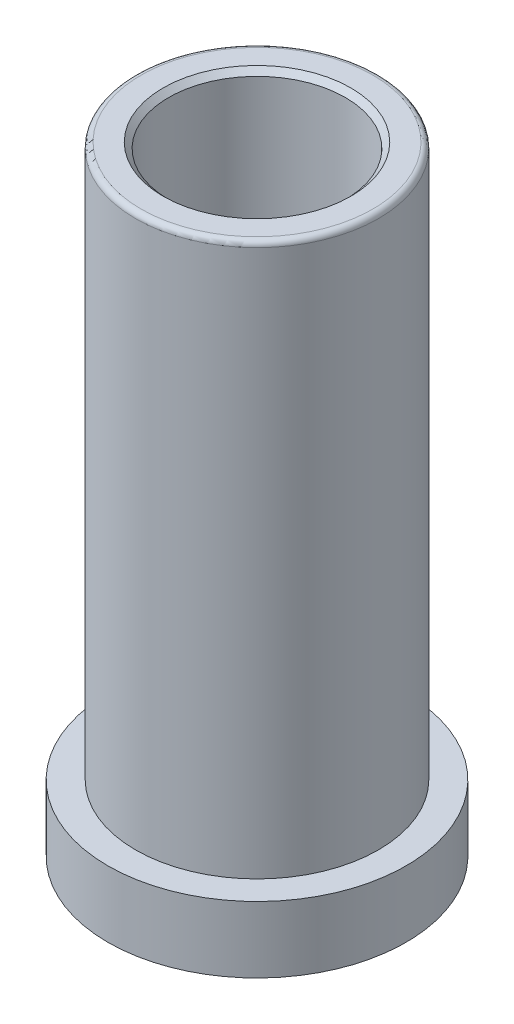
ISO-10303-21;
HEADER;
FILE_DESCRIPTION(('STEP AP214'),'2;1');
FILE_NAME('part.step','',(''),(''),'','','');
FILE_SCHEMA(('AUTOMOTIVE_DESIGN { 1 0 10303 214 1 1 1 1 }'));
ENDSEC;
DATA;
#1=APPLICATION_CONTEXT('core data for automotive mechanical design processes');
#2=APPLICATION_PROTOCOL_DEFINITION('international standard','automotive_design',2000,#1);
#3=PRODUCT_CONTEXT('',#1,'mechanical');
#4=PRODUCT('Part','Part','',(#3));
#5=PRODUCT_RELATED_PRODUCT_CATEGORY('part','',(#4));
#6=PRODUCT_DEFINITION_FORMATION('','',#4);
#7=PRODUCT_DEFINITION_CONTEXT('part definition',#1,'design');
#8=PRODUCT_DEFINITION('design','',#6,#7);
#9=PRODUCT_DEFINITION_SHAPE('','',#8);
#10=(LENGTH_UNIT() NAMED_UNIT(*) SI_UNIT(.MILLI.,.METRE.));
#11=(NAMED_UNIT(*) PLANE_ANGLE_UNIT() SI_UNIT($,.RADIAN.));
#12=(NAMED_UNIT(*) SI_UNIT($,.STERADIAN.) SOLID_ANGLE_UNIT());
#13=UNCERTAINTY_MEASURE_WITH_UNIT(LENGTH_MEASURE(1.E-05),#10,'distance_accuracy_value','');
#14=(GEOMETRIC_REPRESENTATION_CONTEXT(3) GLOBAL_UNCERTAINTY_ASSIGNED_CONTEXT((#13)) GLOBAL_UNIT_ASSIGNED_CONTEXT((#10,
#11,#12)) REPRESENTATION_CONTEXT('',''));
#15=CARTESIAN_POINT('',(0.,0.,0.));
#16=DIRECTION('',(0.,0.,1.));
#17=DIRECTION('',(1.,0.,0.));
#18=AXIS2_PLACEMENT_3D('',#15,#16,#17);
#19=CARTESIAN_POINT('',(0.,0.,0.));
#20=DIRECTION('',(0.,-1.,0.));
#21=DIRECTION('',(0.,0.,-1.));
#22=AXIS2_PLACEMENT_3D('',#19,#20,#21);
#23=CYLINDRICAL_SURFACE('',#22,11.);
#24=CARTESIAN_POINT('',(0.,49.5,0.));
#25=DIRECTION('',(0.,-1.,0.));
#26=DIRECTION('',(0.,0.,-1.));
#27=AXIS2_PLACEMENT_3D('',#24,#25,#26);
#28=CIRCLE('',#27,11.);
#29=CARTESIAN_POINT('',(0.,49.5,-11.));
#30=VERTEX_POINT('',#29);
#31=EDGE_CURVE('E21',#30,#30,#28,.T.);
#32=ORIENTED_EDGE('',*,*,#31,.T.);
#33=EDGE_LOOP('',(#32));
#34=FACE_BOUND('',#33,.T.);
#35=CARTESIAN_POINT('',(0.,0.,0.));
#36=DIRECTION('',(0.,-1.,0.));
#37=DIRECTION('',(0.,0.,-1.));
#38=AXIS2_PLACEMENT_3D('',#35,#36,#37);
#39=CIRCLE('',#38,11.);
#40=CARTESIAN_POINT('',(0.,0.,-11.));
#41=VERTEX_POINT('',#40);
#42=EDGE_CURVE('E49',#41,#41,#39,.T.);
#43=ORIENTED_EDGE('',*,*,#42,.F.);
#44=EDGE_LOOP('',(#43));
#45=FACE_BOUND('',#44,.T.);
#46=ADVANCED_FACE('F14',(#34,#45),#23,.T.);
#47=CARTESIAN_POINT('',(-11.,50.,0.));
#48=DIRECTION('',(0.,-1.,0.));
#49=DIRECTION('',(0.,0.,-1.));
#50=AXIS2_PLACEMENT_3D('',#47,#48,#49);
#51=PLANE('',#50);
#52=CARTESIAN_POINT('',(0.,50.,0.));
#53=DIRECTION('',(0.,-1.,0.));
#54=DIRECTION('',(0.,0.,-1.));
#55=AXIS2_PLACEMENT_3D('',#52,#53,#54);
#56=CIRCLE('',#55,10.5);
#57=CARTESIAN_POINT('',(0.,50.,-10.5));
#58=VERTEX_POINT('',#57);
#59=EDGE_CURVE('E9',#58,#58,#56,.F.);
#60=ORIENTED_EDGE('',*,*,#59,.T.);
#61=EDGE_LOOP('',(#60));
#62=FACE_BOUND('',#61,.T.);
#63=CARTESIAN_POINT('',(0.,50.,0.));
#64=DIRECTION('',(0.,-1.,0.));
#65=DIRECTION('',(0.,0.,-1.));
#66=AXIS2_PLACEMENT_3D('',#63,#64,#65);
#67=CIRCLE('',#66,8.5);
#68=CARTESIAN_POINT('',(0.,50.,-8.5));
#69=VERTEX_POINT('',#68);
#70=EDGE_CURVE('E37',#69,#69,#67,.T.);
#71=ORIENTED_EDGE('',*,*,#70,.T.);
#72=EDGE_LOOP('',(#71));
#73=FACE_BOUND('',#72,.T.);
#74=ADVANCED_FACE('F56',(#62,#73),#51,.F.);
#75=CARTESIAN_POINT('',(0.,0.,0.));
#76=DIRECTION('',(0.,-1.,0.));
#77=DIRECTION('',(0.,0.,-1.));
#78=AXIS2_PLACEMENT_3D('',#75,#76,#77);
#79=CYLINDRICAL_SURFACE('',#78,8.);
#80=CARTESIAN_POINT('',(0.,49.5,0.));
#81=DIRECTION('',(0.,-1.,0.));
#82=DIRECTION('',(0.,0.,-1.));
#83=AXIS2_PLACEMENT_3D('',#80,#81,#82);
#84=CIRCLE('',#83,8.);
#85=CARTESIAN_POINT('',(0.,49.5,-8.));
#86=VERTEX_POINT('',#85);
#87=EDGE_CURVE('E34',#86,#86,#84,.F.);
#88=ORIENTED_EDGE('',*,*,#87,.T.);
#89=EDGE_LOOP('',(#88));
#90=FACE_BOUND('',#89,.T.);
#91=CARTESIAN_POINT('',(0.,-6.,0.));
#92=DIRECTION('',(0.,-1.,0.));
#93=DIRECTION('',(0.,0.,-1.));
#94=AXIS2_PLACEMENT_3D('',#91,#92,#93);
#95=CIRCLE('',#94,8.);
#96=CARTESIAN_POINT('',(0.,-6.,-8.));
#97=VERTEX_POINT('',#96);
#98=EDGE_CURVE('E40',#97,#97,#95,.T.);
#99=ORIENTED_EDGE('',*,*,#98,.T.);
#100=EDGE_LOOP('',(#99));
#101=FACE_BOUND('',#100,.T.);
#102=ADVANCED_FACE('F63',(#90,#101),#79,.F.);
#103=CARTESIAN_POINT('',(0.,-6.15,0.));
#104=DIRECTION('',(0.,-1.,0.));
#105=DIRECTION('',(0.,0.,-1.));
#106=AXIS2_PLACEMENT_3D('',#103,#104,#105);
#107=CONICAL_SURFACE('',#106,8.1,0.588002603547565);
#108=CARTESIAN_POINT('',(0.,-6.36,0.));
#109=DIRECTION('',(0.,1.,0.));
#110=DIRECTION('',(0.,0.,1.));
#111=AXIS2_PLACEMENT_3D('',#108,#109,#110);
#112=CIRCLE('',#111,8.24);
#113=CARTESIAN_POINT('',(0.,-6.36,8.24));
#114=VERTEX_POINT('',#113);
#115=EDGE_CURVE('E25',#114,#114,#112,.F.);
#116=ORIENTED_EDGE('',*,*,#115,.T.);
#117=EDGE_LOOP('',(#116));
#118=FACE_BOUND('',#117,.T.);
#119=ORIENTED_EDGE('',*,*,#98,.F.);
#120=EDGE_LOOP('',(#119));
#121=FACE_BOUND('',#120,.T.);
#122=ADVANCED_FACE('F82',(#118,#121),#107,.F.);
#123=CARTESIAN_POINT('',(-8.1,-6.,0.));
#124=DIRECTION('',(0.,1.,0.));
#125=DIRECTION('',(0.,0.,1.));
#126=AXIS2_PLACEMENT_3D('',#123,#124,#125);
#127=PLANE('',#126);
#128=CARTESIAN_POINT('',(0.,-6.,0.));
#129=DIRECTION('',(0.,1.,0.));
#130=DIRECTION('',(0.,0.,1.));
#131=AXIS2_PLACEMENT_3D('',#128,#129,#130);
#132=CIRCLE('',#131,8.6);
#133=CARTESIAN_POINT('',(0.,-6.,8.6));
#134=VERTEX_POINT('',#133);
#135=EDGE_CURVE('E29',#134,#134,#132,.T.);
#136=ORIENTED_EDGE('',*,*,#135,.T.);
#137=EDGE_LOOP('',(#136));
#138=FACE_BOUND('',#137,.T.);
#139=CARTESIAN_POINT('',(0.,-6.,0.));
#140=DIRECTION('',(0.,-1.,0.));
#141=DIRECTION('',(0.,0.,-1.));
#142=AXIS2_PLACEMENT_3D('',#139,#140,#141);
#143=CIRCLE('',#142,13.5);
#144=CARTESIAN_POINT('',(0.,-6.,-13.5));
#145=VERTEX_POINT('',#144);
#146=EDGE_CURVE('E43',#145,#145,#143,.T.);
#147=ORIENTED_EDGE('',*,*,#146,.T.);
#148=EDGE_LOOP('',(#147));
#149=FACE_BOUND('',#148,.T.);
#150=ADVANCED_FACE('F85',(#138,#149),#127,.F.);
#151=CARTESIAN_POINT('',(0.,0.,0.));
#152=DIRECTION('',(0.,-1.,0.));
#153=DIRECTION('',(0.,0.,-1.));
#154=AXIS2_PLACEMENT_3D('',#151,#152,#153);
#155=CYLINDRICAL_SURFACE('',#154,13.5);
#156=ORIENTED_EDGE('',*,*,#146,.F.);
#157=EDGE_LOOP('',(#156));
#158=FACE_BOUND('',#157,.T.);
#159=CARTESIAN_POINT('',(0.,0.,0.));
#160=DIRECTION('',(0.,-1.,0.));
#161=DIRECTION('',(0.,0.,-1.));
#162=AXIS2_PLACEMENT_3D('',#159,#160,#161);
#163=CIRCLE('',#162,13.5);
#164=CARTESIAN_POINT('',(0.,0.,-13.5));
#165=VERTEX_POINT('',#164);
#166=EDGE_CURVE('E46',#165,#165,#163,.T.);
#167=ORIENTED_EDGE('',*,*,#166,.T.);
#168=EDGE_LOOP('',(#167));
#169=FACE_BOUND('',#168,.T.);
#170=ADVANCED_FACE('F97',(#158,#169),#155,.T.);
#171=CARTESIAN_POINT('',(-13.5,0.,0.));
#172=DIRECTION('',(0.,-1.,0.));
#173=DIRECTION('',(0.,0.,-1.));
#174=AXIS2_PLACEMENT_3D('',#171,#172,#173);
#175=PLANE('',#174);
#176=ORIENTED_EDGE('',*,*,#166,.F.);
#177=EDGE_LOOP('',(#176));
#178=FACE_BOUND('',#177,.T.);
#179=ORIENTED_EDGE('',*,*,#42,.T.);
#180=EDGE_LOOP('',(#179));
#181=FACE_BOUND('',#180,.T.);
#182=ADVANCED_FACE('F53',(#178,#181),#175,.F.);
#183=CARTESIAN_POINT('',(0.,50.,0.));
#184=DIRECTION('',(0.,1.,0.));
#185=DIRECTION('',(0.,0.,1.));
#186=AXIS2_PLACEMENT_3D('',#183,#184,#185);
#187=CONICAL_SURFACE('',#186,8.5,0.785398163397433);
#188=ORIENTED_EDGE('',*,*,#87,.F.);
#189=EDGE_LOOP('',(#188));
#190=FACE_BOUND('',#189,.T.);
#191=ORIENTED_EDGE('',*,*,#70,.F.);
#192=EDGE_LOOP('',(#191));
#193=FACE_BOUND('',#192,.T.);
#194=ADVANCED_FACE('F67',(#190,#193),#187,.F.);
#195=CARTESIAN_POINT('',(0.,-6.5,0.));
#196=DIRECTION('',(0.,1.,0.));
#197=DIRECTION('',(0.,0.,1.));
#198=AXIS2_PLACEMENT_3D('',#195,#196,#197);
#199=CONICAL_SURFACE('',#198,8.1,0.785398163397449);
#200=ORIENTED_EDGE('',*,*,#135,.F.);
#201=EDGE_LOOP('',(#200));
#202=FACE_BOUND('',#201,.T.);
#203=ORIENTED_EDGE('',*,*,#115,.F.);
#204=EDGE_LOOP('',(#203));
#205=FACE_BOUND('',#204,.T.);
#206=ADVANCED_FACE('F69',(#202,#205),#199,.T.);
#207=CARTESIAN_POINT('',(0.,49.5,0.));
#208=DIRECTION('',(0.,-1.,0.));
#209=DIRECTION('',(0.,0.,-1.));
#210=AXIS2_PLACEMENT_3D('',#207,#208,#209);
#211=TOROIDAL_SURFACE('',#210,10.5,0.5);
#212=ORIENTED_EDGE('',*,*,#59,.F.);
#213=EDGE_LOOP('',(#212));
#214=FACE_BOUND('',#213,.T.);
#215=ORIENTED_EDGE('',*,*,#31,.F.);
#216=EDGE_LOOP('',(#215));
#217=FACE_BOUND('',#216,.T.);
#218=ADVANCED_FACE('F16',(#214,#217),#211,.T.);
#219=CLOSED_SHELL('',(#46,#74,#102,#122,#150,#170,#182,#194,#206,#218));
#220=MANIFOLD_SOLID_BREP('B1',#219);
#221=ADVANCED_BREP_SHAPE_REPRESENTATION('',(#18,#220),#14);
#222=SHAPE_DEFINITION_REPRESENTATION(#9,#221);
ENDSEC;
END-ISO-10303-21;
